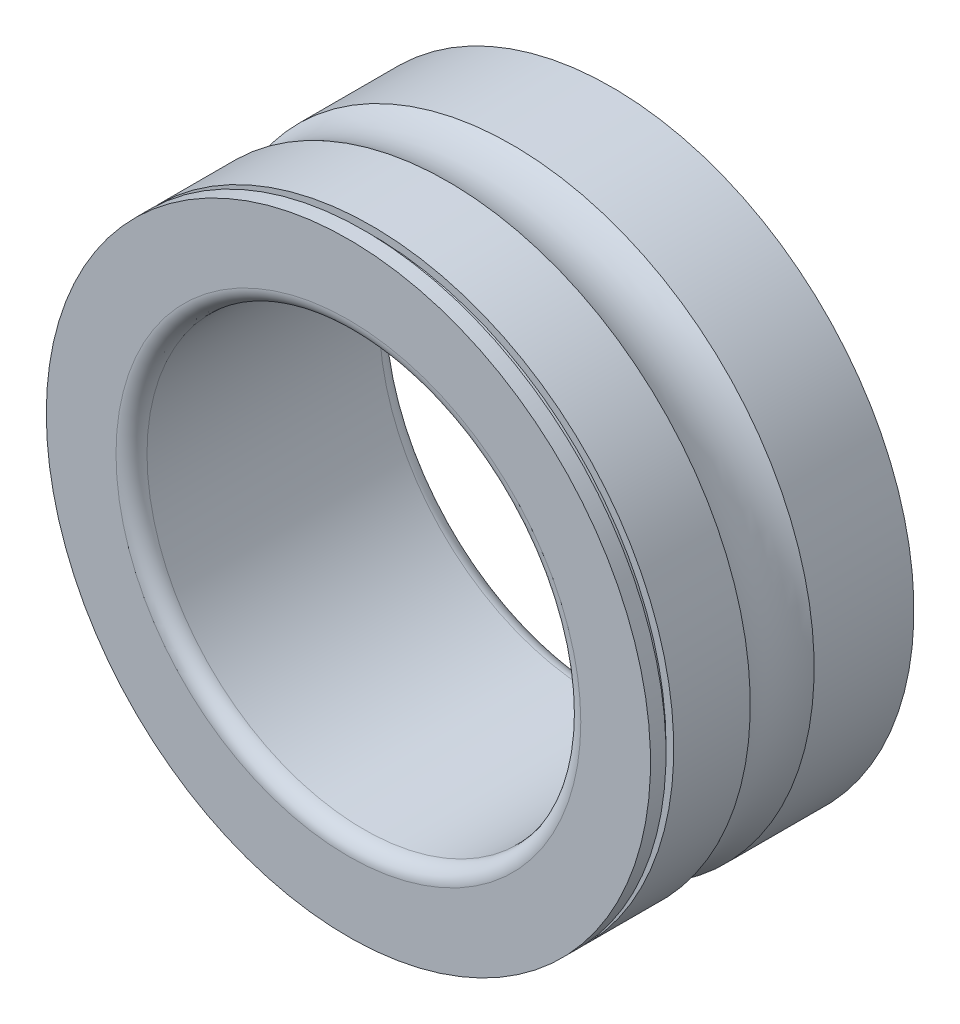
from build123d import *


with BuildPart() as part:
    # Esquisse1 → Base-R_volution (revolve)
    with BuildSketch(Plane(origin=(0, 0, 0), x_dir=(0, 0, -1), z_dir=(1, 0, 0)), mode=Mode.PRIVATE) as base_r_volution_sk:
        with BuildLine():
            Line((-4.25, 9.75), (-3.75, 9.75))
            Line((-3.75, 9.75), (-3.75, 9.5))
            Line((-3.75, 9.5), (-3.5, 9.5))
            Line((-3.5, 9.5), (-3.5, 9.75))
            Line((-3.5, 9.75), (-1.030776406, 9.75))
            ThreePointArc((-1.030776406, 9.75), (0, 9.5), (1.030776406, 9.75))
            Line((1.030776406, 9.75), (4.25, 9.75))
            Line((4.25, 9.75), (4.25, 7.5))
            ThreePointArc((4.25, 7.5), (4.103553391, 7.146446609), (3.75, 7))
            Line((3.75, 7), (-3.75, 7))
            ThreePointArc((-3.75, 7), (-4.103553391, 7.146446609), (-4.25, 7.5))
            Line((-4.25, 7.5), (-4.25, 9.75))
        make_face()
    revolve(base_r_volution_sk.sketch.rotate(Axis((0, 0, 0), (0, 0, 1)), 90), axis=Axis((0, 0, 0), (0, 0, 1)))


solid = part.part
